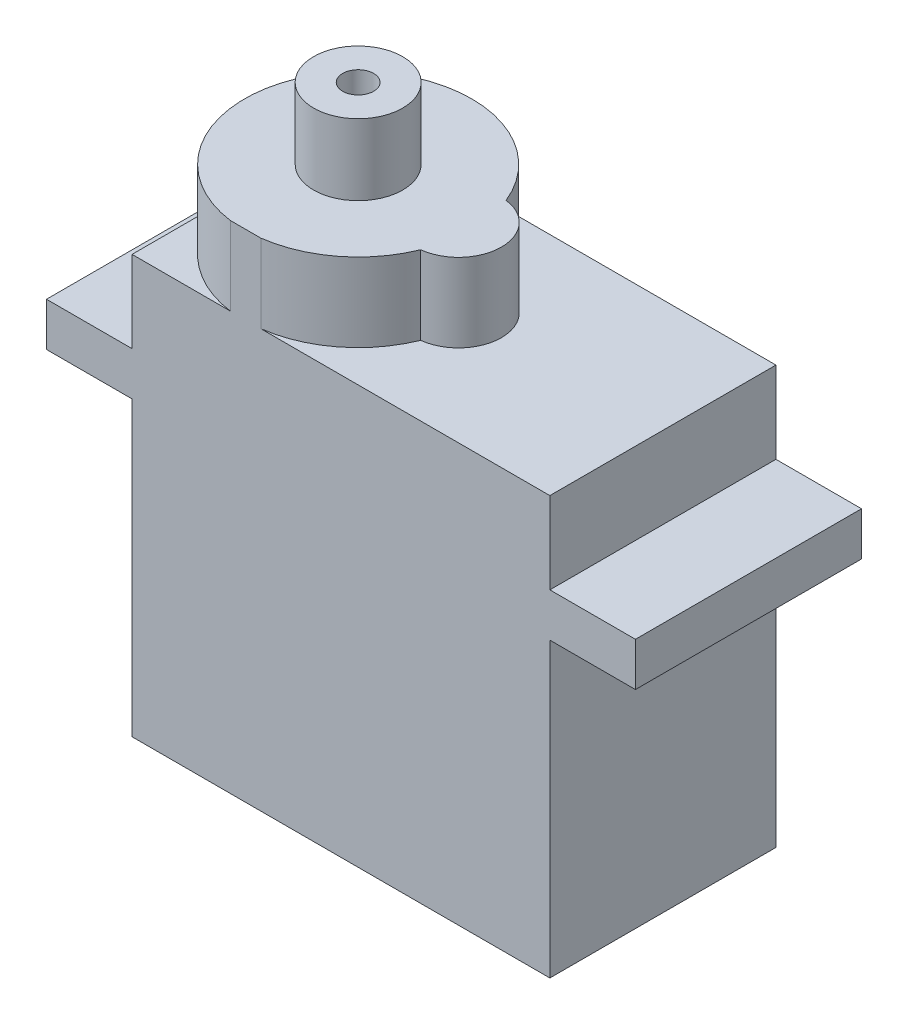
from build123d import *

# Parameters (mm, degrees)
SKETCH1_W           = 22.36
SKETCH1_H           = 22.36
BOSS_EXTRUDE1_DEPTH = 12.1
SKETCH2_W           = 12.1
SKETCH2_H           = 2.33
BOSS_EXTRUDE2_DEPTH = 4.58
SKETCH5_W           = 12.1
SKETCH5_H           = 2.33
BOSS_EXTRUDE5_DEPTH = 4.58
BOSS_EXTRUDE6_DEPTH = 4.2
SKETCH8_R           = 2.385
BOSS_EXTRUDE7_DEPTH = 3.8
SKETCH9_R           = 0.83
CUT_EXTRUDE1_DEPTH  = 4.05


with BuildPart() as part:
    # Sketch1 → Boss-Extrude1 (new body)
    with BuildSketch(Plane.XY):
        with Locations((-5.608652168, 8.135529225)):
            Rectangle(SKETCH1_W, SKETCH1_H)
    extrude(amount=BOSS_EXTRUDE1_DEPTH)

    # Sketch2 → Boss-Extrude2 (add)
    with BuildSketch(Plane(origin=(5.571347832, 0, 0), x_dir=(0, 0, -1), z_dir=(1, 0, 0))):
        with Locations((-6.05, 13.780529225)):
            Rectangle(SKETCH2_W, SKETCH2_H)
    extrude(amount=BOSS_EXTRUDE2_DEPTH)

    # Sketch5 → Boss-Extrude5 (add)
    with BuildSketch(Plane.ZY.offset(16.788652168)):
        with Locations((6.05, 13.780529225)):
            Rectangle(SKETCH5_W, SKETCH5_H)
    extrude(amount=BOSS_EXTRUDE5_DEPTH)

    # Sketch7 → Boss-Extrude6 (add)
    with BuildSketch(Plane(origin=(0, 19.315529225, 0), x_dir=(1, 0, 0), z_dir=(0, 1, 0))):
        with BuildLine():
            ThreePointArc((-5.079928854, -8.362413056), (-4.746504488, -7.241430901), (-4.633973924, -6.077339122))
            ThreePointArc((-4.633973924, -6.077339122), (-4.746504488, -4.913247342), (-5.079928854, -3.792265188))
            ThreePointArc((-5.079928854, -3.792265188), (-15.513174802, -2.352265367), (-11.524705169, -12.1))
            Line((-11.524705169, -12.1), (-9.897920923, -12.1))
            ThreePointArc((-9.897920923, -12.1), (-6.986239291, -10.879200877), (-5.079928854, -8.362413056))
        make_face()
        with BuildLine():
            ThreePointArc((-5.079928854, -3.792265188), (-4.746504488, -4.913247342), (-4.633973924, -6.077339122))
            ThreePointArc((-4.633973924, -6.077339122), (-4.746504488, -7.241430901), (-5.079928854, -8.362413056))
            ThreePointArc((-5.079928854, -8.362413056), (-3.041533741, -6.077339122), (-5.079928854, -3.792265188))
        make_face()
    extrude(amount=BOSS_EXTRUDE6_DEPTH)

    # Sketch8 → Boss-Extrude7 (add)
    with BuildSketch(Plane(origin=(0, 23.515529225, 0), x_dir=(1, 0, 0), z_dir=(0, 1, 0))):
        with Locations(Location((-10.711313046, -6.077339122, 0), (0, 0, 90))):
            Circle(SKETCH8_R)
    extrude(amount=BOSS_EXTRUDE7_DEPTH)

    # Sketch9 → Cut-Extrude1 (cut)
    with BuildSketch(Plane(origin=(0, 27.315529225, 0), x_dir=(1, 0, 0), z_dir=(0, 1, 0))):
        with Locations(Location((-10.711313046, -6.077339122, 0), (0, 0, 270))):
            Circle(SKETCH9_R)
    extrude(amount=-CUT_EXTRUDE1_DEPTH, mode=Mode.SUBTRACT)


solid = part.part
